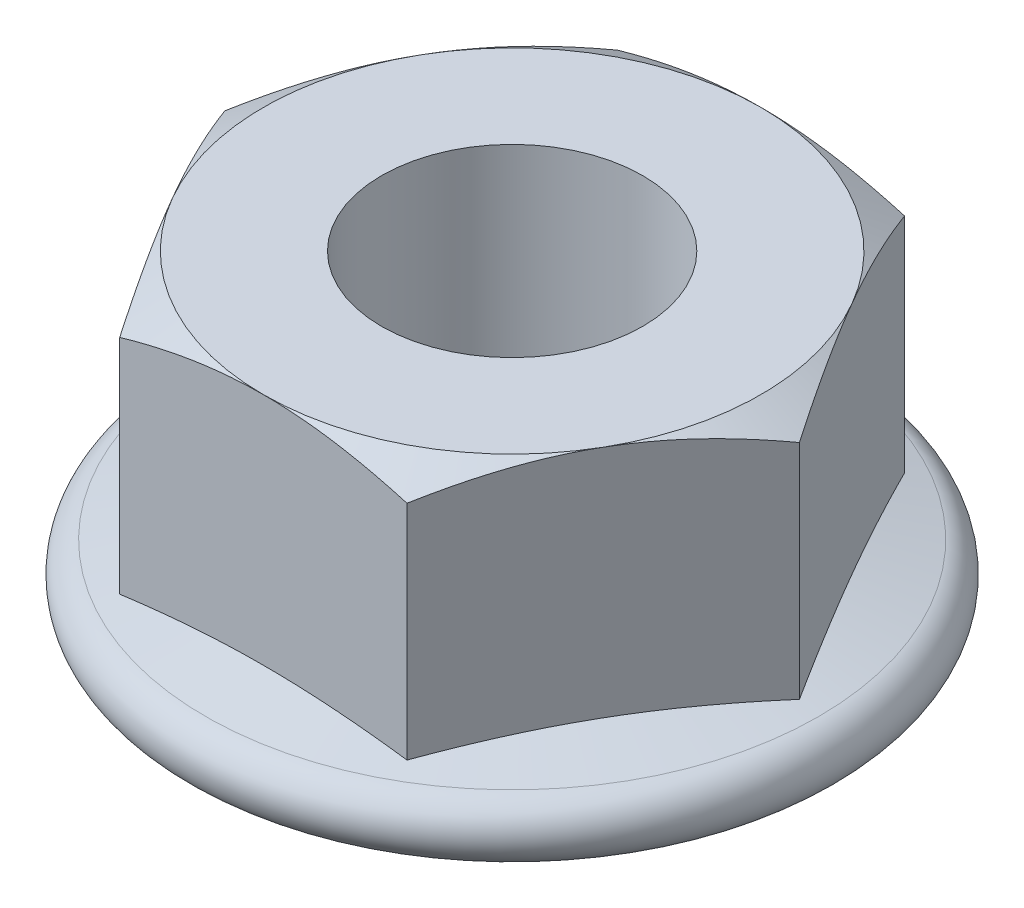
from build123d import *

# Parameters (mm, degrees)
BOSS_EXTRUDE1_DEPTH       = 5
SKETCH2_OUTSIDE_W         = 31.2
SKETCH2_OUTSIDE_H         = 29.962
SKETCH2_OUTSIDE_R         = 4
CUT_EXTRUDE1_DEPTH        = 5
CUT_EXTRUDE1_DRAFT        = 60
M5X0_8_TAPPED_HOLE1_D     = 4.2
M5X0_8_TAPPED_HOLE1_DEPTH = 14
M5X0_8_TAPPED_HOLE1_TIP   = 1.2618073


with BuildPart() as part:
    # Sketch1 → Boss-Extrude1 (new body)
    with BuildSketch(Plane(origin=(0, 0, 0), x_dir=(1, 0, 0), z_dir=(0, 1, 0))):
        Polygon((-4.618802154, 0), (-2.309401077, -4), (2.309401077, -4), (4.618802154, 0), (2.309401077, 4), (-2.309401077, 4), align=None)
    extrude(amount=BOSS_EXTRUDE1_DEPTH)


with BuildPart() as cut_extrude1_tool:
    # Sketch2 outside → Cut-Extrude1 (with draft: the straight prism first)
    with BuildSketch(Plane.XZ.offset(-5)):
        Rectangle(SKETCH2_OUTSIDE_W, SKETCH2_OUTSIDE_H)
        Circle(SKETCH2_OUTSIDE_R, mode=Mode.SUBTRACT)
    extrude(amount=CUT_EXTRUDE1_DEPTH)
    # Cut-Extrude1: the draft: its side faces are tilted about the plane it starts from
    cut_extrude1_sides = [cut_extrude1_tool.faces().sort_by_distance(p)[0] for p in [
        (0, 2.5, -14.981),
        (15.6, 2.5, 0),
        (0, 2.5, 14.981),
        (-15.6, 2.5, 0),
        (-4, 2.5, 0),
    ]]
    draft(cut_extrude1_sides, Plane.XZ.offset(-5), CUT_EXTRUDE1_DRAFT)


with BuildPart() as part_1:
    add(part.part)

    # Cut-Extrude1: cut by cut_extrude1_tool
    add(cut_extrude1_tool.part, mode=Mode.SUBTRACT)

    # Sketch7 → Revolve1 (revolve)
    with BuildSketch(Plane.XY):
        with BuildLine():
            Line((0, 0), (4.8, 0))
            ThreePointArc((4.8, 0), (5.295722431, 0.434736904), (4.929409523, 0.982962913))
            Line((4.929409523, 0.982962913), (0, 2.303794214))
            Line((0, 2.303794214), (0, 0))
        make_face()
    revolve(axis=Axis((0, 0, 0), (0, 1, 0)))

    # M5x0.8 Tapped Hole1
    with Locations(Plane(origin=(0, 5, 0), x_dir=(1, 0, 0), z_dir=(0, 1, 0))):
        with Locations((0, 0)):
            Hole(M5X0_8_TAPPED_HOLE1_D / 2, depth=M5X0_8_TAPPED_HOLE1_DEPTH)
            with Locations((0, 0, -(M5X0_8_TAPPED_HOLE1_DEPTH + M5X0_8_TAPPED_HOLE1_TIP / 2))):  # 118° drill point
                Cone(0, M5X0_8_TAPPED_HOLE1_D / 2, M5X0_8_TAPPED_HOLE1_TIP, mode=Mode.SUBTRACT)


solid = part_1.part
